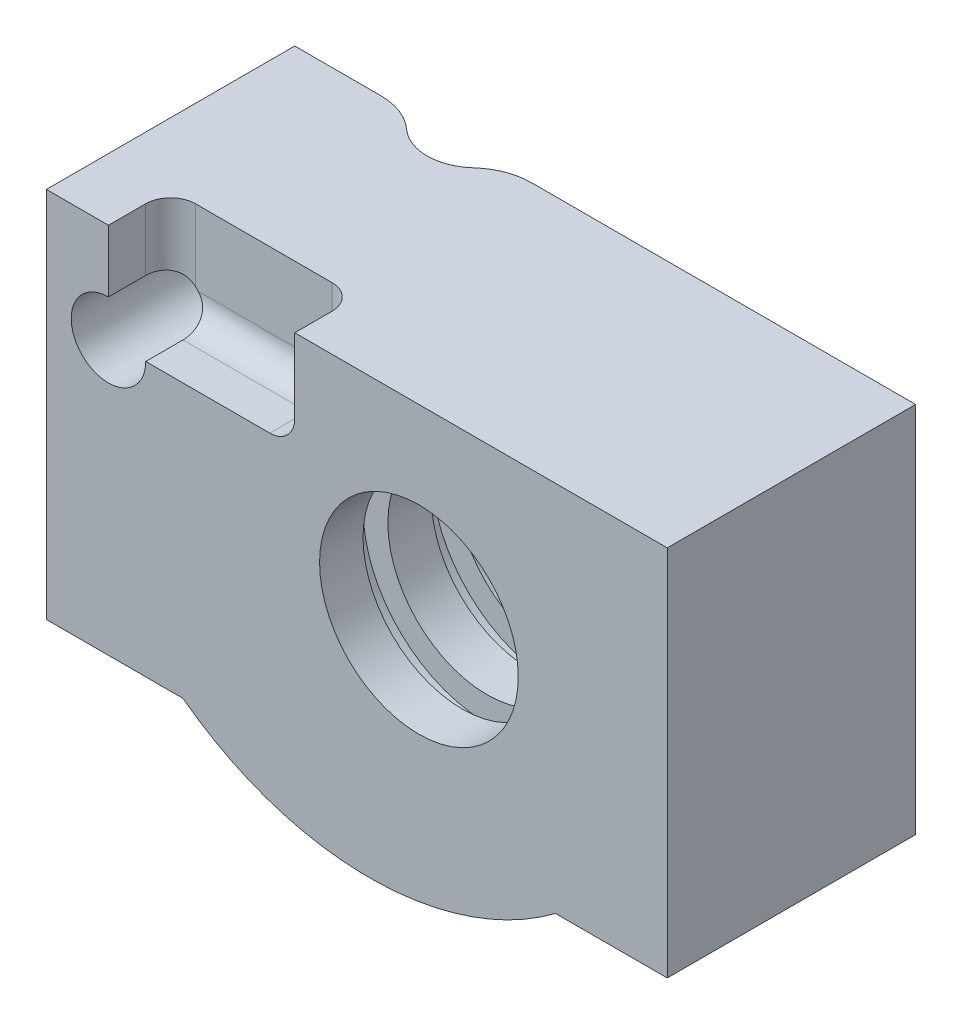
from build123d import *

# Parameters (mm, degrees)
EXTRUDE_1_DEPTH                  = 20
SKETCH_8_R                       = 4
CUT_EXTRUDE_3_DEPTH              = 51.249378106
FILLET_2_R                       = 5
EXTRUDE_2_REACH                  = 43.231
EXTRUDE_2_END_RADIUS             = 10
SKETCH_4_W                       = 1
SKETCH_4_H                       = 1.37957238
EXTRUDE_2_DIRECTION_2_REACH      = 43.231
EXTRUDE_2_DIRECTION_2_END_RADIUS = 10
SKETCH_5_W                       = 15
SKETCH_5_H                       = 8
CUT_EXTRUDE_1_DEPTH              = 5
FILLET_1_R                       = 2
SKETCH_6_R                       = 3
CUT_EXTRUDE_2_DEPTH              = 42.231056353
SKETCH_9_R                       = 2.734702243
CUT_EXTRUDE_4_DEPTH              = 42.231056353
SKETCH_12_R                      = 0.75
FILLET_6_R                       = 0.5
PATTERN_CIRCULAR_1_COUNT         = 3
EXTRUDE_3_DEPTH                  = 17.6


with BuildPart() as part:
    # Sketch 2 → Extrude 1 (new body)
    with BuildSketch(Plane.XY):
        with BuildLine():
            Line((-30, 15), (20, 15))
            Line((20, 15), (20, -15))
            Line((20, -15), (11, -15))
            ThreePointArc((11, -15), (-4, -20), (-19, -15))
            Line((-19, -15), (-30, -15))
            Line((-30, -15), (-30, 15))
        make_face()
    extrude(amount=EXTRUDE_1_DEPTH)

    # Sketch 8 → Cut-Extrude 3 (cut, through all)
    with BuildSketch(Plane(origin=(0, 15, 0), x_dir=(1, 0, 0), z_dir=(0, 1, 0))):
        with Locations((-17, 1.660325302)):
            Circle(SKETCH_8_R)
    extrude(amount=-CUT_EXTRUDE_3_DEPTH, mode=Mode.SUBTRACT)

    # Fillet 2
    fillet_2_edges = [part.edges().sort_by_distance(p)[0] for p in [
        (-20.639137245, 0, 0),
        (-13.360862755, -1.590667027, 0),
    ]]
    fillet(fillet_2_edges, radius=FILLET_2_R)

    # Sketch 3 → Cut-Revolve 1 (revolve, cut)
    with BuildSketch(Plane(origin=(0, 0, 0), x_dir=(1, 0, 0), z_dir=(0, 1, 0))):
        Polygon((0, 0), (-8, 0), (-8, -3.5), (-10, -3.5), (-10, -5.5), (-8, -5.5), (-8, -9), (-10, -9), (-10, -11), (-8, -11), (-8, -14.5), (-10, -14.5), (-10, -16.5), (-8, -16.5), (-8, -20), (0, -20), align=None)
    revolve(axis=Axis((0, 0, 0), (0, 0, 1)), mode=Mode.SUBTRACT)

    # Extrude 2: up to this cylinder (the profile starts inside it)
    extrude_2_end = Plane(origin=(0, 0, 15.5), z_dir=(0, 0, -1)) * Cylinder(EXTRUDE_2_END_RADIUS, 107.462, mode=Mode.PRIVATE)
    # Sketch 4 → Extrude 2 (add, up to the surface)
    with BuildSketch(Plane(origin=(0, 0, 0), x_dir=(0, 0, -1), z_dir=(1, 0, 0)), mode=Mode.PRIVATE) as extrude_2_sk1:
        with Locations((-15.5, 9.99745912)):
            Rectangle(SKETCH_4_W, SKETCH_4_H)
    extrude_2_tool1 = extrude(extrude_2_sk1.sketch, amount=EXTRUDE_2_REACH, mode=Mode.PRIVATE) & extrude_2_end
    add(extrude_2_tool1.solids().sort_by_distance((0, 9.997459, 15.5))[0])

    # Extrude 2 direction 2: up to this cylinder (the profile starts inside it)
    extrude_2_direction_2_end = Plane(origin=(0, 0, 15.5), z_dir=(0, 0, -1)) * Cylinder(EXTRUDE_2_DIRECTION_2_END_RADIUS, 107.462, mode=Mode.PRIVATE)
    # Sketch 4 → Extrude 2 direction 2 (add, up to the surface)
    with BuildSketch(Plane(origin=(0, 0, 0), x_dir=(0, 0, -1), z_dir=(1, 0, 0)), mode=Mode.PRIVATE) as extrude_2_direction_2_sk1:
        with Locations((-15.5, 9.99745912)):
            Rectangle(SKETCH_4_W, SKETCH_4_H)
    extrude_2_direction_2_tool1 = extrude(extrude_2_direction_2_sk1.sketch, amount=-EXTRUDE_2_DIRECTION_2_REACH, mode=Mode.PRIVATE) & extrude_2_direction_2_end
    add(extrude_2_direction_2_tool1.solids().sort_by_distance((0, 9.997459, 15.5))[0])

    # Sketch 5 → Cut-Extrude 1 (cut)
    with BuildSketch(Plane.XY.offset(20)):
        with Locations((-17.5, 11)):
            Rectangle(SKETCH_5_W, SKETCH_5_H)
    extrude(amount=-CUT_EXTRUDE_1_DEPTH, mode=Mode.SUBTRACT)

    # Fillet 1
    fillet_1_edges = [part.edges().sort_by_distance(p)[0] for p in [
        (-25, 11, 15),
        (-25, 7, 17.5),
        (-10, 11, 15),
        (-17.5, 7, 15),
        (-10, 7, 17.5),
    ]]
    fillet(fillet_1_edges, radius=FILLET_1_R)

    # Sketch 6 → Cut-Extrude 2 (cut, through all)
    with BuildSketch(Plane.XY.offset(20)):
        with Locations((-25, 7)):
            Circle(SKETCH_6_R)
    extrude(amount=-CUT_EXTRUDE_2_DEPTH, mode=Mode.SUBTRACT)

    # Sketch 9 → Cut-Extrude 4 (cut, through all)
    with BuildSketch(Plane.XY.offset(20)):
        with Locations((-15, -3)):
            Circle(SKETCH_9_R)
    extrude(amount=-CUT_EXTRUDE_4_DEPTH, mode=Mode.SUBTRACT)

    # Sketch 10 → Cut-Revolve 4 (revolve, cut)
    with BuildSketch(Plane(origin=(-15, 0, 0), x_dir=(0, 0, -1), z_dir=(1, 0, 0)), mode=Mode.PRIVATE) as cut_revolve_4_sk:
        Polygon((-19, -5), (0, -5), (0, -3), (-20, -3), (-20, -8), (-19, -8), align=None)
    revolve(cut_revolve_4_sk.sketch.rotate(Axis((-15, -3, 20), (0, 0, -1)), 345.379782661), axis=Axis((-15, -3, 20), (0, 0, -1)), mode=Mode.SUBTRACT)


with BuildPart() as body_2:
    # Sweep 1: sweep along a path in Sketch 11
    with BuildLine(Plane(origin=(-15, 0, 0), x_dir=(0, 0, -1), z_dir=(1, 0, 0))) as sweep_1_path:
        Line((-17, 1), (-16, 1))
        ThreePointArc((-16, 1), (-14.585786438, 0.414213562), (-14, -1))
        Line((-14, -1), (-14, -5))
        ThreePointArc((-14, -5), (-14.585786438, -6.414213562), (-16, -7))
        Line((-16, -7), (-17, -7))
    # Sketch 12 → Sweep 1 (sweep)
    with BuildSketch(Plane(origin=(-15, 1, 17), x_dir=(-1, 0, 0), z_dir=(0, 0, -1))):
        with Locations((0.001816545, 0.017168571)):
            Circle(SKETCH_12_R)
    sweep(path=sweep_1_path.line)

    # Fillet 6
    fillet_6_edges = [body_2.edges().sort_by_distance(p)[0] for p in [
        (-14.251816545, 1.017168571, 17),
        (-14.251816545, -7.017168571, 17),
    ]]
    fillet(fillet_6_edges, radius=FILLET_6_R)


with BuildPart() as body_3:
    # Mirror 1: mirrored copy
    add(body_2.part.mirror(Plane.XY.offset(13)))


with BuildPart() as pattern_circular_1_1:
    # Pattern Circular 1: pattern copy
    add(body_3.part.rotate(Axis((-15, -3, 0), (0, 0, 1)), 1 * 360 / PATTERN_CIRCULAR_1_COUNT))


with BuildPart() as pattern_circular_1_2:
    # Pattern Circular 1: pattern copy
    add(body_3.part.rotate(Axis((-15, -3, 0), (0, 0, 1)), 2 * 360 / PATTERN_CIRCULAR_1_COUNT))


with BuildPart() as pattern_circular_1_3:
    # Pattern Circular 1: pattern copy
    add(body_2.part.rotate(Axis((-15, -3, 0), (0, 0, 1)), 1 * 360 / PATTERN_CIRCULAR_1_COUNT))


with BuildPart() as pattern_circular_1_4:
    # Pattern Circular 1: pattern copy
    add(body_2.part.rotate(Axis((-15, -3, 0), (0, 0, 1)), 2 * 360 / PATTERN_CIRCULAR_1_COUNT))


with BuildPart() as part_1:
    add(part.part)

    # Combine 1: cut body 2, Pattern Circular 1_4, Pattern Circular 1_3, Pattern Circular 1_1, body 3, Pattern Circular 1_2
    add(body_2.part, mode=Mode.SUBTRACT)
    add(pattern_circular_1_4.part, mode=Mode.SUBTRACT)
    add(pattern_circular_1_3.part, mode=Mode.SUBTRACT)
    add(pattern_circular_1_1.part, mode=Mode.SUBTRACT)
    add(body_3.part, mode=Mode.SUBTRACT)
    add(pattern_circular_1_2.part, mode=Mode.SUBTRACT)

    # Sketch 13 → Extrude 3 (add)
    with BuildSketch(Plane(origin=(0, 7, 5), x_dir=(1, 0, 0), z_dir=(0, -1, 0))):
        Polygon((-20.625759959, 15), (-20.625759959, -0.433568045), (-10.317098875, -0.433568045), (-10.317098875, 12.587898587), (-9.231976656, 12.587898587), (-9.231976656, 15), align=None)
    extrude(amount=EXTRUDE_3_DEPTH)


solid = part_1.part
